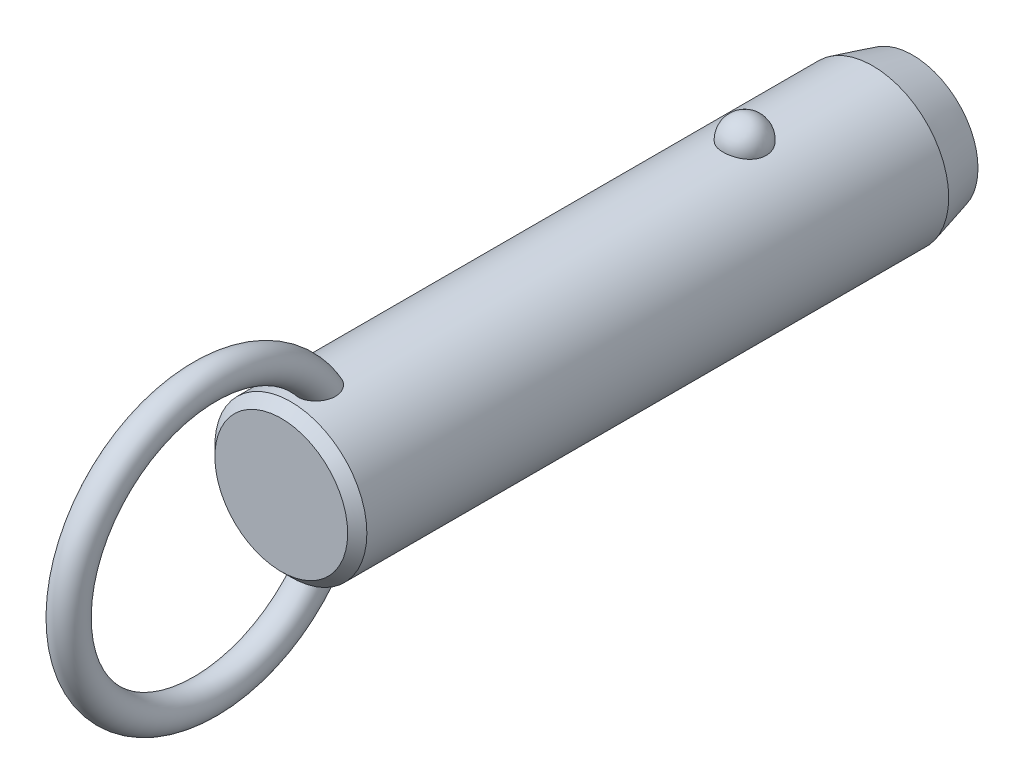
ISO-10303-21;
HEADER;
FILE_DESCRIPTION(('STEP AP214'),'2;1');
FILE_NAME('part.step','',(''),(''),'','','');
FILE_SCHEMA(('AUTOMOTIVE_DESIGN { 1 0 10303 214 1 1 1 1 }'));
ENDSEC;
DATA;
#1=APPLICATION_CONTEXT('core data for automotive mechanical design processes');
#2=APPLICATION_PROTOCOL_DEFINITION('international standard','automotive_design',2000,#1);
#3=PRODUCT_CONTEXT('',#1,'mechanical');
#4=PRODUCT('Part','Part','',(#3));
#5=PRODUCT_RELATED_PRODUCT_CATEGORY('part','',(#4));
#6=PRODUCT_DEFINITION_FORMATION('','',#4);
#7=PRODUCT_DEFINITION_CONTEXT('part definition',#1,'design');
#8=PRODUCT_DEFINITION('design','',#6,#7);
#9=PRODUCT_DEFINITION_SHAPE('','',#8);
#10=(LENGTH_UNIT() NAMED_UNIT(*) SI_UNIT(.MILLI.,.METRE.));
#11=(NAMED_UNIT(*) PLANE_ANGLE_UNIT() SI_UNIT($,.RADIAN.));
#12=(NAMED_UNIT(*) SI_UNIT($,.STERADIAN.) SOLID_ANGLE_UNIT());
#13=UNCERTAINTY_MEASURE_WITH_UNIT(LENGTH_MEASURE(1.E-05),#10,'distance_accuracy_value','');
#14=(GEOMETRIC_REPRESENTATION_CONTEXT(3) GLOBAL_UNCERTAINTY_ASSIGNED_CONTEXT((#13)) GLOBAL_UNIT_ASSIGNED_CONTEXT((#10,
#11,#12)) REPRESENTATION_CONTEXT('',''));
#15=CARTESIAN_POINT('',(0.,0.,0.));
#16=DIRECTION('',(0.,0.,1.));
#17=DIRECTION('',(1.,0.,0.));
#18=AXIS2_PLACEMENT_3D('',#15,#16,#17);
#19=CARTESIAN_POINT('',(0.,0.,45.7));
#20=DIRECTION('',(0.,0.,-1.));
#21=DIRECTION('',(-1.,0.,0.));
#22=AXIS2_PLACEMENT_3D('',#19,#20,#21);
#23=CYLINDRICAL_SURFACE('',#22,9.5);
#24=CARTESIAN_POINT('',(2.67259918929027,9.11631578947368,-2.7));
#25=CARTESIAN_POINT('',(2.6725968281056,9.11631786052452,-2.54909854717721));
#26=CARTESIAN_POINT('',(2.66030567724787,9.11994722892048,-2.39816735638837));
#27=CARTESIAN_POINT('',(2.6114347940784,9.13405924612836,-2.10058568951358));
#28=CARTESIAN_POINT('',(2.57484658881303,9.14454428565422,-1.95393672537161));
#29=CARTESIAN_POINT('',(2.47830875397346,9.17117631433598,-1.66916069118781));
#30=CARTESIAN_POINT('',(2.41836936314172,9.18732082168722,-1.53102991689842));
#31=CARTESIAN_POINT('',(2.27661331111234,9.22346780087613,-1.26705393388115));
#32=CARTESIAN_POINT('',(2.19479699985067,9.24347021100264,-1.14120852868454));
#33=CARTESIAN_POINT('',(2.01085282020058,9.28522401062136,-0.904632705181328));
#34=CARTESIAN_POINT('',(1.90862396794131,9.30698376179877,-0.793982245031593));
#35=CARTESIAN_POINT('',(1.6867437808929,9.34973971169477,-0.591607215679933));
#36=CARTESIAN_POINT('',(1.56709244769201,9.37073591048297,-0.49988264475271));
#37=CARTESIAN_POINT('',(1.31393976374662,9.40956370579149,-0.338167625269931));
#38=CARTESIAN_POINT('',(1.18048026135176,9.42740444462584,-0.268113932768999));
#39=CARTESIAN_POINT('',(0.903154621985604,9.45799906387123,-0.151390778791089));
#40=CARTESIAN_POINT('',(0.759289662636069,9.47075351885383,-0.104718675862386));
#41=CARTESIAN_POINT('',(0.468074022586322,9.48956256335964,-0.0367633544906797));
#42=CARTESIAN_POINT('',(0.320836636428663,9.49573643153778,-0.015027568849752));
#43=CARTESIAN_POINT('',(0.0246714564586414,9.50112183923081,0.00396199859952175));
#44=CARTESIAN_POINT('',(-0.124256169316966,9.50033406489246,0.00121819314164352));
#45=CARTESIAN_POINT('',(-0.417264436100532,9.4919475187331,-0.0284441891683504));
#46=CARTESIAN_POINT('',(-0.56138413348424,9.48444885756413,-0.0550074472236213));
#47=CARTESIAN_POINT('',(-0.842986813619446,9.46357853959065,-0.131064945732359));
#48=CARTESIAN_POINT('',(-0.980469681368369,9.450206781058,-0.180559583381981));
#49=CARTESIAN_POINT('',(-1.24585005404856,9.41890822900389,-0.301476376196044));
#50=CARTESIAN_POINT('',(-1.37368611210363,9.40095498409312,-0.373026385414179));
#51=CARTESIAN_POINT('',(-1.61552738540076,9.3624296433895,-0.536025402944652));
#52=CARTESIAN_POINT('',(-1.72953116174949,9.34185727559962,-0.627476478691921));
#53=CARTESIAN_POINT('',(-1.9429225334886,9.29984568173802,-0.829844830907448));
#54=CARTESIAN_POINT('',(-2.04198021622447,9.27839736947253,-0.941108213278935));
#55=CARTESIAN_POINT('',(-2.2202646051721,9.23735994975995,-1.17883414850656));
#56=CARTESIAN_POINT('',(-2.29948985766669,9.21777097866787,-1.30529781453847));
#57=CARTESIAN_POINT('',(-2.43697287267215,9.18238994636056,-1.57158566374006));
#58=CARTESIAN_POINT('',(-2.49497068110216,9.16664569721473,-1.71155057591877));
#59=CARTESIAN_POINT('',(-2.5872073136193,9.14104303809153,-1.99961197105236));
#60=CARTESIAN_POINT('',(-2.62144683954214,9.13118445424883,-2.14770821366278));
#61=CARTESIAN_POINT('',(-2.66521466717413,9.11850622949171,-2.44715424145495));
#62=CARTESIAN_POINT('',(-2.67484831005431,9.11565658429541,-2.59848735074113));
#63=CARTESIAN_POINT('',(-2.66946735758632,9.11723375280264,-2.90067317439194));
#64=CARTESIAN_POINT('',(-2.65445345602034,9.12166036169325,-3.05152590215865));
#65=CARTESIAN_POINT('',(-2.60029711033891,9.13724422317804,-3.34766110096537));
#66=CARTESIAN_POINT('',(-2.56127978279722,9.14836656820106,-3.49296833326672));
#67=CARTESIAN_POINT('',(-2.46018844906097,9.17606676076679,-3.77477535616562));
#68=CARTESIAN_POINT('',(-2.39811349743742,9.1926448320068,-3.9112747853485));
#69=CARTESIAN_POINT('',(-2.25202303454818,9.22952198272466,-4.17244273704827));
#70=CARTESIAN_POINT('',(-2.16788714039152,9.24984129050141,-4.29704106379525));
#71=CARTESIAN_POINT('',(-1.9799408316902,9.29188255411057,-4.53013066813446));
#72=CARTESIAN_POINT('',(-1.87612963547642,9.31360456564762,-4.63862130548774));
#73=CARTESIAN_POINT('',(-1.65105429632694,9.35612959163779,-4.8369029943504));
#74=CARTESIAN_POINT('',(-1.52972405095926,9.37692871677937,-4.92661991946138));
#75=CARTESIAN_POINT('',(-1.27318250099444,9.41518970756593,-5.08429106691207));
#76=CARTESIAN_POINT('',(-1.13797219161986,9.432651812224,-5.15224684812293));
#77=CARTESIAN_POINT('',(-0.859280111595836,9.46208255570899,-5.26371827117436));
#78=CARTESIAN_POINT('',(-0.715925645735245,9.47411833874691,-5.30753421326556));
#79=CARTESIAN_POINT('',(-0.423550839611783,9.4916822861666,-5.37076321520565));
#80=CARTESIAN_POINT('',(-0.274531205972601,9.49721125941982,-5.39017930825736));
#81=CARTESIAN_POINT('',(0.0218446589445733,9.50110860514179,-5.40390587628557));
#82=CARTESIAN_POINT('',(0.169177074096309,9.49961381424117,-5.39869609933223));
#83=CARTESIAN_POINT('',(0.460808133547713,9.48993906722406,-5.36441955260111));
#84=CARTESIAN_POINT('',(0.605106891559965,9.48175936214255,-5.33535367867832));
#85=CARTESIAN_POINT('',(0.886027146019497,9.4596376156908,-5.25435587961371));
#86=CARTESIAN_POINT('',(1.02267710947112,9.44571881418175,-5.20251612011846));
#87=CARTESIAN_POINT('',(1.28523827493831,9.41358993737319,-5.07741549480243));
#88=CARTESIAN_POINT('',(1.41114877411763,9.39537958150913,-5.00415322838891));
#89=CARTESIAN_POINT('',(1.65085227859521,9.3562644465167,-4.83684599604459));
#90=CARTESIAN_POINT('',(1.76442346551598,9.33532178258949,-4.74249218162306));
#91=CARTESIAN_POINT('',(1.97425672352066,9.29321198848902,-4.53620389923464));
#92=CARTESIAN_POINT('',(2.07051582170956,9.27204482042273,-4.42426641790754));
#93=CARTESIAN_POINT('',(2.24490086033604,9.23139221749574,-4.18363183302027));
#94=CARTESIAN_POINT('',(2.32267019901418,9.21194380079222,-4.05466990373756));
#95=CARTESIAN_POINT('',(2.45584092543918,9.1773419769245,-3.78517836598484));
#96=CARTESIAN_POINT('',(2.5112497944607,9.16218713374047,-3.64465264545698));
#97=CARTESIAN_POINT('',(2.59380876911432,9.13913522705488,-3.37104301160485));
#98=CARTESIAN_POINT('',(2.62330266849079,9.13064624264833,-3.23871053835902));
#99=CARTESIAN_POINT('',(2.66269870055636,9.11923566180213,-2.97092664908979));
#100=CARTESIAN_POINT('',(2.67260130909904,9.11631393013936,-2.83547530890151));
#101=CARTESIAN_POINT('',(2.67259918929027,9.11631578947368,-2.7));
#102=B_SPLINE_CURVE_WITH_KNOTS('',3,(#24,#25,#26,#27,#28,#29,#30,#31,#32,#33,#34,#35,#36,#37,
#38,#39,#40,#41,#42,#43,#44,#45,#46,#47,#48,#49,#50,#51,#52,#53,#54,#55,#56,#57,#58,#59,#60,#61,
#62,#63,#64,#65,#66,#67,#68,#69,#70,#71,#72,#73,#74,#75,#76,#77,#78,#79,#80,#81,#82,#83,#84,#85,
#86,#87,#88,#89,#90,#91,#92,#93,#94,#95,#96,#97,#98,#99,#100,#101),.UNSPECIFIED.,.T.,.F.,(4,2,2,
2,2,2,2,2,2,2,2,2,2,2,2,2,2,2,2,2,2,2,2,2,2,2,2,2,2,2,2,2,2,2,2,2,2,2,4),(0.,0.452217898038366,
0.904593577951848,1.35677112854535,1.80894144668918,2.26340676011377,2.71787203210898,
3.17099820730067,3.62407318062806,4.0687883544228,4.51345969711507,4.95160616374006,
5.38976021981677,5.83050358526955,6.27129275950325,6.72071308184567,7.17016633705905,
7.62495278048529,8.07972578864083,8.53254856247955,8.98535859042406,9.43582813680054,
9.88631615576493,10.3393155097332,10.7923328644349,11.2471065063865,11.7018475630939,
12.150795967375,12.599688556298,13.0398725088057,13.4800399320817,13.9184421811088,
14.3568730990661,14.802202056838,15.2476074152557,15.7010097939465,16.1542603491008,
16.5602594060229,16.966248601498),.UNSPECIFIED.);
#103=CARTESIAN_POINT('',(2.67259918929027,9.11631578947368,-2.7));
#104=VERTEX_POINT('',#103);
#105=EDGE_CURVE('E41',#104,#104,#102,.T.);
#106=ORIENTED_EDGE('',*,*,#105,.T.);
#107=EDGE_LOOP('',(#106));
#108=FACE_BOUND('',#107,.T.);
#109=CARTESIAN_POINT('',(0.,0.,54.02));
#110=DIRECTION('',(0.,0.,1.));
#111=DIRECTION('',(1.,0.,0.));
#112=AXIS2_PLACEMENT_3D('',#109,#110,#111);
#113=CIRCLE('',#112,9.5);
#114=CARTESIAN_POINT('',(9.5,0.,54.02));
#115=VERTEX_POINT('',#114);
#116=EDGE_CURVE('E10',#115,#115,#113,.F.);
#117=ORIENTED_EDGE('',*,*,#116,.T.);
#118=EDGE_LOOP('',(#117));
#119=FACE_BOUND('',#118,.T.);
#120=CARTESIAN_POINT('',(-0.697062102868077,-9.47439269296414,48.3678088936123));
#121=CARTESIAN_POINT('',(-0.799579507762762,-9.46685146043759,48.4074823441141));
#122=CARTESIAN_POINT('',(-0.898575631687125,-9.45788043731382,48.4559309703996));
#123=CARTESIAN_POINT('',(-1.08670047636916,-9.43811593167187,48.5688685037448));
#124=CARTESIAN_POINT('',(-1.17583204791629,-9.42732297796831,48.633352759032));
#125=CARTESIAN_POINT('',(-1.34179806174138,-9.40513672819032,48.7762099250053));
#126=CARTESIAN_POINT('',(-1.41865133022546,-9.39374438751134,48.854561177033));
#127=CARTESIAN_POINT('',(-1.5586004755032,-9.37154196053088,49.0227524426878));
#128=CARTESIAN_POINT('',(-1.62169476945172,-9.3607319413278,49.1125937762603));
#129=CARTESIAN_POINT('',(-1.73527695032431,-9.34035749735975,49.3045001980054));
#130=CARTESIAN_POINT('',(-1.7852226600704,-9.33085270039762,49.4068910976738));
#131=CARTESIAN_POINT('',(-1.86924997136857,-9.3143834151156,49.618148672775));
#132=CARTESIAN_POINT('',(-1.90332570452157,-9.30741986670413,49.7270177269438));
#133=CARTESIAN_POINT('',(-1.95893603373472,-9.29588482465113,49.9604730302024));
#134=CARTESIAN_POINT('',(-1.97872420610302,-9.29165182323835,50.0854890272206));
#135=CARTESIAN_POINT('',(-2.00062129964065,-9.28695978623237,50.3370805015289));
#136=CARTESIAN_POINT('',(-2.00272284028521,-9.28650232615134,50.463656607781));
#137=CARTESIAN_POINT('',(-1.98958876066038,-9.28932750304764,50.7368157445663));
#138=CARTESIAN_POINT('',(-1.97143366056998,-9.2932400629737,50.8832519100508));
#139=CARTESIAN_POINT('',(-1.91479925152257,-9.30507151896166,51.1720629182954));
#140=CARTESIAN_POINT('',(-1.87629122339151,-9.31299607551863,51.314431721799));
#141=CARTESIAN_POINT('',(-1.77225683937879,-9.33340232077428,51.6151725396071));
#142=CARTESIAN_POINT('',(-1.70334898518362,-9.34641636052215,51.7723691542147));
#143=CARTESIAN_POINT('',(-1.58111062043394,-9.36759153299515,51.9975171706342));
#144=CARTESIAN_POINT('',(-1.53721459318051,-9.37492619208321,52.0707968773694));
#145=CARTESIAN_POINT('',(-1.44302631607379,-9.38988566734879,52.2130740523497));
#146=CARTESIAN_POINT('',(-1.39273721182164,-9.39751033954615,52.2820736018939));
#147=CARTESIAN_POINT('',(-1.26775962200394,-9.41530678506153,52.4369832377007));
#148=CARTESIAN_POINT('',(-1.19052326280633,-9.42548108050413,52.5208712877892));
#149=CARTESIAN_POINT('',(-1.0242024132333,-9.44499825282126,52.6760086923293));
#150=CARTESIAN_POINT('',(-0.935139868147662,-9.45434261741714,52.7472808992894));
#151=CARTESIAN_POINT('',(-0.766610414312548,-9.46930670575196,52.8586955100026));
#152=CARTESIAN_POINT('',(-0.689439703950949,-9.47529223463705,52.9022354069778));
#153=CARTESIAN_POINT('',(-0.528942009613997,-9.48560294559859,52.9763133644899));
#154=CARTESIAN_POINT('',(-0.445620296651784,-9.48992953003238,53.0068624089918));
#155=CARTESIAN_POINT('',(-0.273901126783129,-9.49644161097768,53.0525792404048));
#156=CARTESIAN_POINT('',(-0.185465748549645,-9.49860811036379,53.06761059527));
#157=CARTESIAN_POINT('',(-0.0073454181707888,-9.5004135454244,53.0801494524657));
#158=CARTESIAN_POINT('',(0.0823387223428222,-9.50005405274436,53.0776678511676));
#159=CARTESIAN_POINT('',(0.24767927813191,-9.49708301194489,53.0569959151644));
#160=CARTESIAN_POINT('',(0.323620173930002,-9.49477609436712,53.0409300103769));
#161=CARTESIAN_POINT('',(0.471981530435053,-9.48855917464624,52.9971726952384));
#162=CARTESIAN_POINT('',(0.544400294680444,-9.48464840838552,52.9694757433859));
#163=CARTESIAN_POINT('',(0.708947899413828,-9.47398336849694,52.8928026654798));
#164=CARTESIAN_POINT('',(0.799149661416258,-9.46671310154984,52.8397745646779));
#165=CARTESIAN_POINT('',(0.969783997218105,-9.4507622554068,52.7199731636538));
#166=CARTESIAN_POINT('',(1.05019415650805,-9.44207854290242,52.6531692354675));
#167=CARTESIAN_POINT('',(1.23092343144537,-9.42051459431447,52.4807596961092));
#168=CARTESIAN_POINT('',(1.32652499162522,-9.40733378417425,52.3702619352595));
#169=CARTESIAN_POINT('',(1.49893121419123,-9.38140745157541,52.1355614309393));
#170=CARTESIAN_POINT('',(1.57571616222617,-9.36866239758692,52.0113445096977));
#171=CARTESIAN_POINT('',(1.71285426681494,-9.34457644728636,51.7493891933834));
#172=CARTESIAN_POINT('',(1.77266365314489,-9.33328726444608,51.6113623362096));
#173=CARTESIAN_POINT('',(1.87239208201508,-9.31379209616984,51.3280515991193));
#174=CARTESIAN_POINT('',(1.91230158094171,-9.3055875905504,51.182764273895));
#175=CARTESIAN_POINT('',(1.9760418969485,-9.29228394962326,50.8620281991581));
#176=CARTESIAN_POINT('',(1.99587438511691,-9.28797202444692,50.6857248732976));
#177=CARTESIAN_POINT('',(2.0029570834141,-9.28645519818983,50.3324146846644));
#178=CARTESIAN_POINT('',(1.99025930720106,-9.28923895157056,50.1554093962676));
#179=CARTESIAN_POINT('',(1.93735479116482,-9.30038134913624,49.8563381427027));
#180=CARTESIAN_POINT('',(1.90576827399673,-9.30697680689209,49.7326679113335));
#181=CARTESIAN_POINT('',(1.82287484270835,-9.32356855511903,49.4923297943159));
#182=CARTESIAN_POINT('',(1.77158213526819,-9.33356239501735,49.3756569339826));
#183=CARTESIAN_POINT('',(1.64885744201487,-9.35602275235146,49.1527061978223));
#184=CARTESIAN_POINT('',(1.57730995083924,-9.36850332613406,49.0464927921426));
#185=CARTESIAN_POINT('',(1.41543264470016,-9.39431873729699,48.8495530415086));
#186=CARTESIAN_POINT('',(1.32510883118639,-9.40765330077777,48.7588217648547));
#187=CARTESIAN_POINT('',(1.13846223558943,-9.43195720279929,48.6050334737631));
#188=CARTESIAN_POINT('',(1.04369890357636,-9.44302894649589,48.5400947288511));
#189=CARTESIAN_POINT('',(0.843965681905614,-9.46296805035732,48.4280388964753));
#190=CARTESIAN_POINT('',(0.739000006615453,-9.4718363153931,48.3809144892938));
#191=CARTESIAN_POINT('',(0.528175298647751,-9.48586140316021,48.3081173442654));
#192=CARTESIAN_POINT('',(0.422686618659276,-9.49119633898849,48.2814024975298));
#193=CARTESIAN_POINT('',(0.208590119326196,-9.49831365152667,48.2460137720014));
#194=CARTESIAN_POINT('',(0.0999817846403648,-9.500095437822,48.2373428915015));
#195=CARTESIAN_POINT('',(-0.12610480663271,-9.49988861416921,48.2383501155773));
#196=CARTESIAN_POINT('',(-0.243578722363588,-9.49757821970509,48.2495942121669));
#197=CARTESIAN_POINT('',(-0.474390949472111,-9.48885165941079,48.293167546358));
#198=CARTESIAN_POINT('',(-0.587729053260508,-9.48243528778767,48.3254978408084));
#199=CARTESIAN_POINT('',(-0.697062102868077,-9.47439269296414,48.3678088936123));
#200=B_SPLINE_CURVE_WITH_KNOTS('',3,(#120,#121,#122,#123,#124,#125,#126,#127,#128,#129,#130,
#131,#132,#133,#134,#135,#136,#137,#138,#139,#140,#141,#142,#143,#144,#145,#146,#147,#148,#149,
#150,#151,#152,#153,#154,#155,#156,#157,#158,#159,#160,#161,#162,#163,#164,#165,#166,#167,#168,
#169,#170,#171,#172,#173,#174,#175,#176,#177,#178,#179,#180,#181,#182,#183,#184,#185,#186,#187,
#188,#189,#190,#191,#192,#193,#194,#195,#196,#197,#198,#199),.UNSPECIFIED.,.T.,.F.,(4,2,2,2,2,2,
2,2,2,2,2,2,2,2,2,2,2,2,2,2,2,2,2,2,2,2,2,2,2,2,2,2,2,2,2,2,2,2,2,4),(0.,0.330119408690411,
0.660143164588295,0.989655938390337,1.31920659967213,1.66074728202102,2.00241415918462,
2.38088696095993,2.75951768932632,3.20065679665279,3.6424200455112,4.15620996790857,
4.41314162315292,4.66994734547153,5.01228664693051,5.35399933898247,5.61943037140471,
5.88463652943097,6.15215502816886,6.41950709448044,6.65144391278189,6.88349136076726,
7.19641200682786,7.51003602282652,7.94779711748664,8.38601491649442,8.83699707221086,
9.28819530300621,9.81778662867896,10.3465317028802,10.7284172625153,11.1100280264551,
11.4938603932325,11.8775702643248,12.2220189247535,12.5663259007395,12.8915939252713,
13.2169159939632,13.5689650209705,13.9210316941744),.UNSPECIFIED.);
#201=CARTESIAN_POINT('',(-0.697062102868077,-9.47439269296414,48.3678088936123));
#202=VERTEX_POINT('',#201);
#203=EDGE_CURVE('E59',#202,#202,#200,.T.);
#204=ORIENTED_EDGE('',*,*,#203,.T.);
#205=EDGE_LOOP('',(#204));
#206=FACE_BOUND('',#205,.T.);
#207=CARTESIAN_POINT('',(-0.697062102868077,9.47439269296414,48.3678088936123));
#208=CARTESIAN_POINT('',(-0.597792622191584,9.48169483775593,48.3293956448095));
#209=CARTESIAN_POINT('',(-0.495106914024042,9.48766580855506,48.2991682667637));
#210=CARTESIAN_POINT('',(-0.285876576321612,9.49627648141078,48.2560327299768));
#211=CARTESIAN_POINT('',(-0.179324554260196,9.49890941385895,48.2431597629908));
#212=CARTESIAN_POINT('',(0.0344157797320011,9.50053798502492,48.2351666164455));
#213=CARTESIAN_POINT('',(0.141603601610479,9.49953613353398,48.2400341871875));
#214=CARTESIAN_POINT('',(0.353563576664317,9.49401038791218,48.2673654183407));
#215=CARTESIAN_POINT('',(0.458336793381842,9.48948807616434,48.28982117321));
#216=CARTESIAN_POINT('',(0.662493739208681,9.4774236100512,48.3516719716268));
#217=CARTESIAN_POINT('',(0.761881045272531,9.46988348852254,48.3910556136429));
#218=CARTESIAN_POINT('',(0.952608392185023,9.45260382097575,48.4856342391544));
#219=CARTESIAN_POINT('',(1.04394806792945,9.44286417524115,48.5408299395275));
#220=CARTESIAN_POINT('',(1.21712767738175,9.4221176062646,48.6660662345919));
#221=CARTESIAN_POINT('',(1.29885671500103,9.41109835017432,48.7362579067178));
#222=CARTESIAN_POINT('',(1.4497897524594,9.38903310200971,48.888980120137));
#223=CARTESIAN_POINT('',(1.51899278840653,9.37798710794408,48.9715116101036));
#224=CARTESIAN_POINT('',(1.64602857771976,9.35654375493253,49.1497763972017));
#225=CARTESIAN_POINT('',(1.70333052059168,9.34618688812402,49.2458916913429));
#226=CARTESIAN_POINT('',(1.80259341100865,9.32755128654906,49.445897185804));
#227=CARTESIAN_POINT('',(1.84454942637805,9.31927322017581,49.5497898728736));
#228=CARTESIAN_POINT('',(1.91637039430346,9.30478365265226,49.772213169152));
#229=CARTESIAN_POINT('',(1.944805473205,9.29882552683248,49.8912192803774));
#230=CARTESIAN_POINT('',(1.98449865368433,9.29043398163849,50.1321436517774));
#231=CARTESIAN_POINT('',(1.99574908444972,9.28800213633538,50.2540631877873));
#232=CARTESIAN_POINT('',(2.00275141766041,9.28649645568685,50.5169324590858));
#233=CARTESIAN_POINT('',(1.99588238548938,9.28799035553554,50.6579529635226));
#234=CARTESIAN_POINT('',(1.96270559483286,9.29505517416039,50.9376217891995));
#235=CARTESIAN_POINT('',(1.93637872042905,9.30063010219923,51.076267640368));
#236=CARTESIAN_POINT('',(1.85949176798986,9.31633564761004,51.3725616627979));
#237=CARTESIAN_POINT('',(1.80549792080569,9.3270926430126,51.5292907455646));
#238=CARTESIAN_POINT('',(1.67376869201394,9.3516306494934,51.8322840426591));
#239=CARTESIAN_POINT('',(1.59603181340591,9.36541185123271,51.9785475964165));
#240=CARTESIAN_POINT('',(1.4360277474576,9.39110706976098,52.2258138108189));
#241=CARTESIAN_POINT('',(1.35831795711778,9.40278656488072,52.329791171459));
#242=CARTESIAN_POINT('',(1.18774483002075,9.42585025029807,52.5245347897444));
#243=CARTESIAN_POINT('',(1.09490932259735,9.43723493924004,52.6153247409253));
#244=CARTESIAN_POINT('',(0.921110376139,9.45552616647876,52.7562033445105));
#245=CARTESIAN_POINT('',(0.843738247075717,9.46281058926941,52.8106563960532));
#246=CARTESIAN_POINT('',(0.681245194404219,9.47589120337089,52.906711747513));
#247=CARTESIAN_POINT('',(0.596135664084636,9.48168953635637,52.9483325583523));
#248=CARTESIAN_POINT('',(0.433779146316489,9.49038144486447,53.0100899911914));
#249=CARTESIAN_POINT('',(0.357459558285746,9.49359170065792,53.0326013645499));
#250=CARTESIAN_POINT('',(0.202074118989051,9.49816761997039,53.0645745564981));
#251=CARTESIAN_POINT('',(0.123010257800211,9.49953459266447,53.0740456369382));
#252=CARTESIAN_POINT('',(-0.0357372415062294,9.50026497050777,53.0791143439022));
#253=CARTESIAN_POINT('',(-0.115421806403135,9.49962433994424,53.0746840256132));
#254=CARTESIAN_POINT('',(-0.272823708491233,9.49640854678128,53.0522962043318));
#255=CARTESIAN_POINT('',(-0.35054013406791,9.4938325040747,53.0343325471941));
#256=CARTESIAN_POINT('',(-0.500580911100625,9.4870946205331,52.9868028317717));
#257=CARTESIAN_POINT('',(-0.57297929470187,9.48296359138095,52.9574618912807));
#258=CARTESIAN_POINT('',(-0.712864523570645,9.47347609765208,52.8890087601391));
#259=CARTESIAN_POINT('',(-0.7803490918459,9.46811906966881,52.8498920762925));
#260=CARTESIAN_POINT('',(-0.946309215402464,9.45329720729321,52.739432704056));
#261=CARTESIAN_POINT('',(-1.04090230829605,9.44321512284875,52.6623297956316));
#262=CARTESIAN_POINT('',(-1.21661929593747,9.42219227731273,52.4940971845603));
#263=CARTESIAN_POINT('',(-1.29770519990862,9.41124921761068,52.4029292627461));
#264=CARTESIAN_POINT('',(-1.4731964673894,9.38563439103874,52.1761621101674));
#265=CARTESIAN_POINT('',(-1.56208878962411,9.37102009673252,52.0362895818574));
#266=CARTESIAN_POINT('',(-1.71623987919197,9.34401559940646,51.7439503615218));
#267=CARTESIAN_POINT('',(-1.7814786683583,9.33162728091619,51.5914731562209));
#268=CARTESIAN_POINT('',(-1.88853837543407,9.31055541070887,51.2756470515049));
#269=CARTESIAN_POINT('',(-1.9299899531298,9.30193076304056,51.1121685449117));
#270=CARTESIAN_POINT('',(-1.98590726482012,9.29015757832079,50.7805268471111));
#271=CARTESIAN_POINT('',(-2.00040705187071,9.2870021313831,50.6123698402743));
#272=CARTESIAN_POINT('',(-1.99964701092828,9.28716218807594,50.3050806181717));
#273=CARTESIAN_POINT('',(-1.98908145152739,9.28945704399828,50.1659362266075));
#274=CARTESIAN_POINT('',(-1.94566294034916,9.29865169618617,49.8911539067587));
#275=CARTESIAN_POINT('',(-1.91282062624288,9.30554929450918,49.755514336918));
#276=CARTESIAN_POINT('',(-1.84582133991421,9.31898248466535,49.5578026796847));
#277=CARTESIAN_POINT('',(-1.82038084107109,9.32400364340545,49.4925830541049));
#278=CARTESIAN_POINT('',(-1.76350511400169,9.33492884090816,49.3649033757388));
#279=CARTESIAN_POINT('',(-1.73207305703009,9.3408324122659,49.3024418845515));
#280=CARTESIAN_POINT('',(-1.66324243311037,9.353333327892,49.1809407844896));
#281=CARTESIAN_POINT('',(-1.62584239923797,9.35993084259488,49.1219020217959));
#282=CARTESIAN_POINT('',(-1.545276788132,9.37356864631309,49.0079875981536));
#283=CARTESIAN_POINT('',(-1.50211241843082,9.38060884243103,48.9531110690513));
#284=CARTESIAN_POINT('',(-1.37681147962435,9.40004442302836,48.8099619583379));
#285=CARTESIAN_POINT('',(-1.28916358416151,9.41261047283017,48.7264295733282));
#286=CARTESIAN_POINT('',(-1.09996826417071,9.43658180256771,48.5772360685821));
#287=CARTESIAN_POINT('',(-0.998461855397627,9.44799034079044,48.5115238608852));
#288=CARTESIAN_POINT('',(-0.860188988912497,9.46103017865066,48.4394367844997));
#289=CARTESIAN_POINT('',(-0.828141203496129,9.46389141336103,48.4238511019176));
#290=CARTESIAN_POINT('',(-0.763210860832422,9.46934915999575,48.3944734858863));
#291=CARTESIAN_POINT('',(-0.730328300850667,9.47194567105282,48.3806815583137));
#292=CARTESIAN_POINT('',(-0.697062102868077,9.47439269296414,48.3678088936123));
#293=B_SPLINE_CURVE_WITH_KNOTS('',3,(#207,#208,#209,#210,#211,#212,#213,#214,#215,#216,#217,
#218,#219,#220,#221,#222,#223,#224,#225,#226,#227,#228,#229,#230,#231,#232,#233,#234,#235,#236,
#237,#238,#239,#240,#241,#242,#243,#244,#245,#246,#247,#248,#249,#250,#251,#252,#253,#254,#255,
#256,#257,#258,#259,#260,#261,#262,#263,#264,#265,#266,#267,#268,#269,#270,#271,#272,#273,#274,
#275,#276,#277,#278,#279,#280,#281,#282,#283,#284,#285,#286,#287,#288,#289,#290,#291,#292),
.UNSPECIFIED.,.T.,.F.,(4,2,2,2,2,2,2,2,2,2,2,2,2,2,2,2,2,2,2,2,2,2,2,2,2,2,2,2,2,2,2,2,2,2,2,2,
2,2,2,2,2,2,4),(0.,0.319942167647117,0.640532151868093,0.96090081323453,1.28112555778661,
1.60113495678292,1.92115886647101,2.24457323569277,2.56801248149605,2.90371927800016,
3.23953387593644,3.60560313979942,3.97183576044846,4.39383693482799,4.81625324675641,
5.31257045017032,5.80891895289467,6.19868344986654,6.58773876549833,6.87145417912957,
7.15475838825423,7.3926375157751,7.63034760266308,7.86853584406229,8.10683246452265,
8.3406366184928,8.57454843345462,8.93983939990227,9.30614105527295,9.80266668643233,
10.2996107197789,10.8040753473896,11.3079021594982,11.7249776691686,12.1418541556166,
12.3521485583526,12.562331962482,12.7725671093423,12.9827582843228,13.3458276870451,
13.7078449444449,13.8150604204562,13.9222762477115),.UNSPECIFIED.);
#294=CARTESIAN_POINT('',(-0.697062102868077,9.47439269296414,48.3678088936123));
#295=VERTEX_POINT('',#294);
#296=EDGE_CURVE('E67',#295,#295,#293,.T.);
#297=ORIENTED_EDGE('',*,*,#296,.T.);
#298=EDGE_LOOP('',(#297));
#299=FACE_BOUND('',#298,.T.);
#300=CARTESIAN_POINT('',(0.,0.,-18.7));
#301=DIRECTION('',(0.,0.,-1.));
#302=DIRECTION('',(-1.,0.,0.));
#303=AXIS2_PLACEMENT_3D('',#300,#301,#302);
#304=CIRCLE('',#303,9.5);
#305=CARTESIAN_POINT('',(9.50000000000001,0.,-18.7));
#306=VERTEX_POINT('',#305);
#307=EDGE_CURVE('E56',#306,#306,#304,.F.);
#308=ORIENTED_EDGE('',*,*,#307,.T.);
#309=EDGE_LOOP('',(#308));
#310=FACE_BOUND('',#309,.T.);
#311=ADVANCED_FACE('F37',(#108,#119,#206,#299,#310),#23,.T.);
#312=CARTESIAN_POINT('',(0.,0.,-23.7));
#313=DIRECTION('',(0.,0.,-1.));
#314=DIRECTION('',(-1.,0.,0.));
#315=AXIS2_PLACEMENT_3D('',#312,#313,#314);
#316=PLANE('',#315);
#317=CARTESIAN_POINT('',(0.,0.,-23.7));
#318=DIRECTION('',(0.,0.,-1.));
#319=DIRECTION('',(-1.,0.,0.));
#320=AXIS2_PLACEMENT_3D('',#317,#318,#319);
#321=CIRCLE('',#320,8.16025403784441);
#322=CARTESIAN_POINT('',(8.16025403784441,0.,-23.7));
#323=VERTEX_POINT('',#322);
#324=EDGE_CURVE('E66',#323,#323,#321,.T.);
#325=ORIENTED_EDGE('',*,*,#324,.T.);
#326=EDGE_LOOP('',(#325));
#327=FACE_BOUND('',#326,.T.);
#328=ADVANCED_FACE('F85',(#327),#316,.T.);
#329=CARTESIAN_POINT('',(0.,0.,-23.7));
#330=DIRECTION('',(0.,0.,1.));
#331=DIRECTION('',(1.,0.,0.));
#332=AXIS2_PLACEMENT_3D('',#329,#330,#331);
#333=CONICAL_SURFACE('',#332,8.16025403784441,0.261799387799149);
#334=CARTESIAN_POINT('',(9.50000000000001,0.,-18.7));
#335=CARTESIAN_POINT('',(9.48604431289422,0.,-18.7520833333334));
#336=CARTESIAN_POINT('',(9.47208862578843,0.,-18.8041666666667));
#337=CARTESIAN_POINT('',(9.44417725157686,0.,-18.9083333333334));
#338=CARTESIAN_POINT('',(9.43022156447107,0.,-18.9604166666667));
#339=CARTESIAN_POINT('',(9.40231019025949,0.,-19.0645833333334));
#340=CARTESIAN_POINT('',(9.38835450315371,0.,-19.1166666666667));
#341=CARTESIAN_POINT('',(9.36044312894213,0.,-19.2208333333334));
#342=CARTESIAN_POINT('',(9.34648744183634,0.,-19.2729166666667));
#343=CARTESIAN_POINT('',(9.31857606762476,0.,-19.3770833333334));
#344=CARTESIAN_POINT('',(9.30462038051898,0.,-19.4291666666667));
#345=CARTESIAN_POINT('',(9.2767090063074,0.,-19.5333333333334));
#346=CARTESIAN_POINT('',(9.26275331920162,0.,-19.5854166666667));
#347=CARTESIAN_POINT('',(9.23484194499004,0.,-19.6895833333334));
#348=CARTESIAN_POINT('',(9.22088625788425,0.,-19.7416666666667));
#349=CARTESIAN_POINT('',(9.19297488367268,0.,-19.8458333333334));
#350=CARTESIAN_POINT('',(9.17901919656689,0.,-19.8979166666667));
#351=CARTESIAN_POINT('',(9.15110782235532,0.,-20.0020833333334));
#352=CARTESIAN_POINT('',(9.13715213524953,0.,-20.0541666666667));
#353=CARTESIAN_POINT('',(9.10924076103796,0.,-20.1583333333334));
#354=CARTESIAN_POINT('',(9.09528507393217,0.,-20.2104166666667));
#355=CARTESIAN_POINT('',(9.06737369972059,0.,-20.3145833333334));
#356=CARTESIAN_POINT('',(9.0534180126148,0.,-20.3666666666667));
#357=CARTESIAN_POINT('',(9.02550663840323,0.,-20.4708333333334));
#358=CARTESIAN_POINT('',(9.01155095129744,0.,-20.5229166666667));
#359=CARTESIAN_POINT('',(8.98363957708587,0.,-20.6270833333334));
#360=CARTESIAN_POINT('',(8.96968388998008,0.,-20.6791666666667));
#361=CARTESIAN_POINT('',(8.94177251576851,0.,-20.7833333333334));
#362=CARTESIAN_POINT('',(8.92781682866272,0.,-20.8354166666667));
#363=CARTESIAN_POINT('',(8.89990545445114,0.,-20.9395833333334));
#364=CARTESIAN_POINT('',(8.88594976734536,0.,-20.9916666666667));
#365=CARTESIAN_POINT('',(8.85803839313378,0.,-21.0958333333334));
#366=CARTESIAN_POINT('',(8.84408270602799,0.,-21.1479166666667));
#367=CARTESIAN_POINT('',(8.81617133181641,0.,-21.2520833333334));
#368=CARTESIAN_POINT('',(8.80221564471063,0.,-21.3041666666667));
#369=CARTESIAN_POINT('',(8.77430427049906,0.,-21.4083333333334));
#370=CARTESIAN_POINT('',(8.76034858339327,0.,-21.4604166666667));
#371=CARTESIAN_POINT('',(8.73243720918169,0.,-21.5645833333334));
#372=CARTESIAN_POINT('',(8.71848152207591,0.,-21.6166666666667));
#373=CARTESIAN_POINT('',(8.69057014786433,0.,-21.7208333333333));
#374=CARTESIAN_POINT('',(8.67661446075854,0.,-21.7729166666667));
#375=CARTESIAN_POINT('',(8.64870308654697,0.,-21.8770833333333));
#376=CARTESIAN_POINT('',(8.63474739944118,0.,-21.9291666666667));
#377=CARTESIAN_POINT('',(8.60683602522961,0.,-22.0333333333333));
#378=CARTESIAN_POINT('',(8.59288033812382,0.,-22.0854166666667));
#379=CARTESIAN_POINT('',(8.56496896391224,0.,-22.1895833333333));
#380=CARTESIAN_POINT('',(8.55101327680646,0.,-22.2416666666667));
#381=CARTESIAN_POINT('',(8.52310190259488,0.,-22.3458333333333));
#382=CARTESIAN_POINT('',(8.50914621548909,0.,-22.3979166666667));
#383=CARTESIAN_POINT('',(8.48123484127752,0.,-22.5020833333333));
#384=CARTESIAN_POINT('',(8.46727915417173,0.,-22.5541666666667));
#385=CARTESIAN_POINT('',(8.43936777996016,0.,-22.6583333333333));
#386=CARTESIAN_POINT('',(8.42541209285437,0.,-22.7104166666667));
#387=CARTESIAN_POINT('',(8.39750071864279,0.,-22.8145833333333));
#388=CARTESIAN_POINT('',(8.38354503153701,0.,-22.8666666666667));
#389=CARTESIAN_POINT('',(8.35563365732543,0.,-22.9708333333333));
#390=CARTESIAN_POINT('',(8.34167797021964,0.,-23.0229166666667));
#391=CARTESIAN_POINT('',(8.31376659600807,0.,-23.1270833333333));
#392=CARTESIAN_POINT('',(8.29981090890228,0.,-23.1791666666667));
#393=CARTESIAN_POINT('',(8.2718995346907,0.,-23.2833333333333));
#394=CARTESIAN_POINT('',(8.25794384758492,0.,-23.3354166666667));
#395=CARTESIAN_POINT('',(8.23003247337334,0.,-23.4395833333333));
#396=CARTESIAN_POINT('',(8.21607678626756,0.,-23.4916666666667));
#397=CARTESIAN_POINT('',(8.18816541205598,0.,-23.5958333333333));
#398=CARTESIAN_POINT('',(8.17420972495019,0.,-23.6479166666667));
#399=CARTESIAN_POINT('',(8.16025403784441,0.,-23.7));
#400=B_SPLINE_CURVE_WITH_KNOTS('',3,(#334,#335,#336,#337,#338,#339,#340,#341,#342,#343,#344,
#345,#346,#347,#348,#349,#350,#351,#352,#353,#354,#355,#356,#357,#358,#359,#360,#361,#362,#363,
#364,#365,#366,#367,#368,#369,#370,#371,#372,#373,#374,#375,#376,#377,#378,#379,#380,#381,#382,
#383,#384,#385,#386,#387,#388,#389,#390,#391,#392,#393,#394,#395,#396,#397,#398,#399),
.UNSPECIFIED.,.F.,.F.,(4,2,2,2,2,2,2,2,2,2,2,2,2,2,2,2,2,2,2,2,2,2,2,2,2,2,2,2,2,2,2,2,4),(0.,
0.161761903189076,0.323523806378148,0.485285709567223,0.647047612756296,0.808809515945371,
0.970571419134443,1.13233332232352,1.29409522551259,1.45585712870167,1.61761903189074,
1.77938093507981,1.94114283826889,2.10290474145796,2.26466664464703,2.42642854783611,
2.58819045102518,2.74995235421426,2.91171425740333,3.0734761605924,3.23523806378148,
3.39699996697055,3.55876187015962,3.7205237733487,3.88228567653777,4.04404757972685,
4.20580948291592,4.36757138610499,4.52933328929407,4.69109519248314,4.85285709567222,
5.01461899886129,5.17638090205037),.UNSPECIFIED.);
#401=EDGE_CURVE('BSEAM83',#306,#323,#400,.T.);
#402=ORIENTED_EDGE('',*,*,#307,.F.);
#403=ORIENTED_EDGE('',*,*,#324,.F.);
#404=ORIENTED_EDGE('',*,*,#401,.T.);
#405=ORIENTED_EDGE('',*,*,#401,.F.);
#406=EDGE_LOOP('',(#402,#404,#403,#405));
#407=FACE_BOUND('',#406,.T.);
#408=ADVANCED_FACE('F83',(#407),#333,.T.);
#409=CARTESIAN_POINT('',(0.,0.,55.22));
#410=DIRECTION('',(0.,0.,1.));
#411=DIRECTION('',(1.,0.,0.));
#412=AXIS2_PLACEMENT_3D('',#409,#410,#411);
#413=PLANE('',#412);
#414=CARTESIAN_POINT('',(0.,0.,55.22));
#415=DIRECTION('',(0.,0.,1.));
#416=DIRECTION('',(1.,0.,0.));
#417=AXIS2_PLACEMENT_3D('',#414,#415,#416);
#418=CIRCLE('',#417,8.30000000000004);
#419=CARTESIAN_POINT('',(8.30000000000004,0.,55.22));
#420=VERTEX_POINT('',#419);
#421=EDGE_CURVE('E50',#420,#420,#418,.T.);
#422=ORIENTED_EDGE('',*,*,#421,.T.);
#423=EDGE_LOOP('',(#422));
#424=FACE_BOUND('',#423,.T.);
#425=ADVANCED_FACE('F77',(#424),#413,.T.);
#426=CARTESIAN_POINT('',(0.,0.,64.75));
#427=DIRECTION('',(1.,0.,0.));
#428=DIRECTION('',(0.,0.,-1.));
#429=AXIS2_PLACEMENT_3D('',#426,#427,#428);
#430=TOROIDAL_SURFACE('',#429,17.05,2.);
#431=ORIENTED_EDGE('',*,*,#296,.F.);
#432=EDGE_LOOP('',(#431));
#433=FACE_BOUND('',#432,.T.);
#434=ORIENTED_EDGE('',*,*,#203,.F.);
#435=EDGE_LOOP('',(#434));
#436=FACE_BOUND('',#435,.T.);
#437=ADVANCED_FACE('F73',(#433,#436),#430,.T.);
#438=CARTESIAN_POINT('',(0.,0.,55.22));
#439=DIRECTION('',(0.,0.,-1.));
#440=DIRECTION('',(-1.,0.,0.));
#441=AXIS2_PLACEMENT_3D('',#438,#439,#440);
#442=CONICAL_SURFACE('',#441,8.30000000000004,0.785398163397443);
#443=ORIENTED_EDGE('',*,*,#116,.F.);
#444=EDGE_LOOP('',(#443));
#445=FACE_BOUND('',#444,.T.);
#446=ORIENTED_EDGE('',*,*,#421,.F.);
#447=EDGE_LOOP('',(#446));
#448=FACE_BOUND('',#447,.T.);
#449=ADVANCED_FACE('F39',(#445,#448),#442,.T.);
#450=CARTESIAN_POINT('',(0.,9.5,-2.7));
#451=DIRECTION('',(0.,1.,0.));
#452=DIRECTION('',(0.,0.,-1.));
#453=AXIS2_PLACEMENT_3D('',#450,#451,#452);
#454=SPHERICAL_SURFACE('',#453,2.7);
#455=ORIENTED_EDGE('',*,*,#105,.F.);
#456=EDGE_LOOP('',(#455));
#457=FACE_BOUND('',#456,.T.);
#458=ADVANCED_FACE('F79',(#457),#454,.T.);
#459=CLOSED_SHELL('',(#311,#328,#408,#425,#437,#449,#458));
#460=MANIFOLD_SOLID_BREP('B2',#459);
#461=ADVANCED_BREP_SHAPE_REPRESENTATION('',(#18,#460),#14);
#462=SHAPE_DEFINITION_REPRESENTATION(#9,#461);
ENDSEC;
END-ISO-10303-21;
